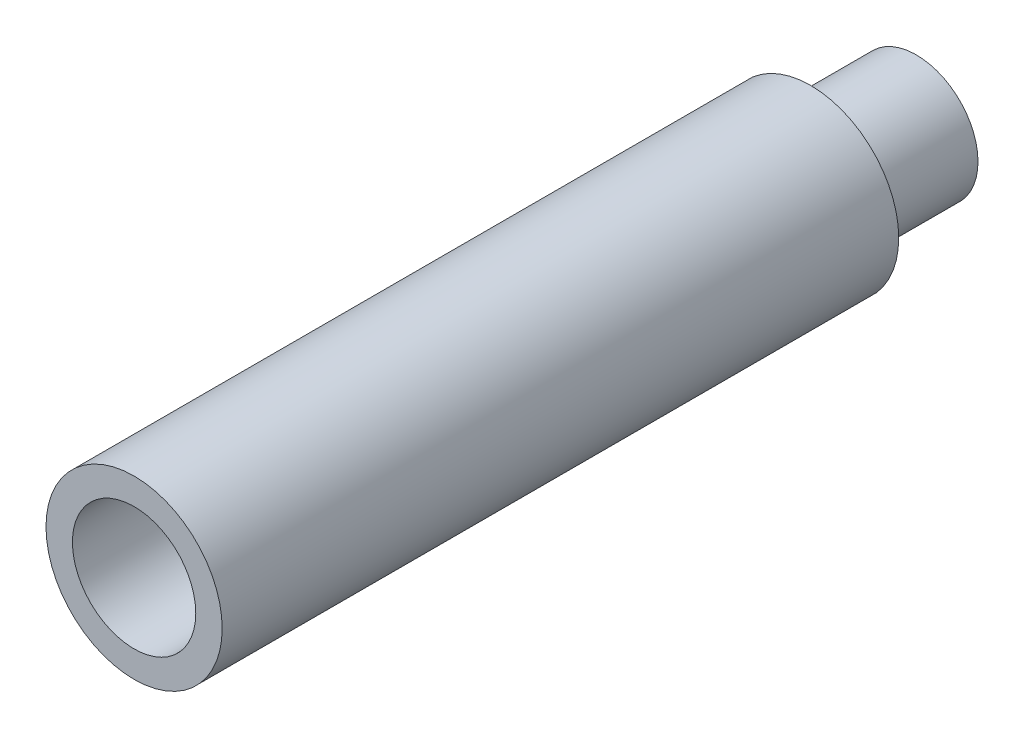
ISO-10303-21;
HEADER;
FILE_DESCRIPTION(('STEP AP214'),'2;1');
FILE_NAME('part.step','',(''),(''),'','','');
FILE_SCHEMA(('AUTOMOTIVE_DESIGN { 1 0 10303 214 1 1 1 1 }'));
ENDSEC;
DATA;
#1=APPLICATION_CONTEXT('core data for automotive mechanical design processes');
#2=APPLICATION_PROTOCOL_DEFINITION('international standard','automotive_design',2000,#1);
#3=PRODUCT_CONTEXT('',#1,'mechanical');
#4=PRODUCT('Part','Part','',(#3));
#5=PRODUCT_RELATED_PRODUCT_CATEGORY('part','',(#4));
#6=PRODUCT_DEFINITION_FORMATION('','',#4);
#7=PRODUCT_DEFINITION_CONTEXT('part definition',#1,'design');
#8=PRODUCT_DEFINITION('design','',#6,#7);
#9=PRODUCT_DEFINITION_SHAPE('','',#8);
#10=(LENGTH_UNIT() NAMED_UNIT(*) SI_UNIT(.MILLI.,.METRE.));
#11=(NAMED_UNIT(*) PLANE_ANGLE_UNIT() SI_UNIT($,.RADIAN.));
#12=(NAMED_UNIT(*) SI_UNIT($,.STERADIAN.) SOLID_ANGLE_UNIT());
#13=UNCERTAINTY_MEASURE_WITH_UNIT(LENGTH_MEASURE(1.E-05),#10,'distance_accuracy_value','');
#14=(GEOMETRIC_REPRESENTATION_CONTEXT(3) GLOBAL_UNCERTAINTY_ASSIGNED_CONTEXT((#13)) GLOBAL_UNIT_ASSIGNED_CONTEXT((#10,
#11,#12)) REPRESENTATION_CONTEXT('',''));
#15=CARTESIAN_POINT('',(0.,0.,0.));
#16=DIRECTION('',(0.,0.,1.));
#17=DIRECTION('',(1.,0.,0.));
#18=AXIS2_PLACEMENT_3D('',#15,#16,#17);
#19=CARTESIAN_POINT('',(0.,0.,-60.96));
#20=DIRECTION('',(0.,0.,1.));
#21=DIRECTION('',(1.,0.,0.));
#22=AXIS2_PLACEMENT_3D('',#19,#20,#21);
#23=PLANE('',#22);
#24=CARTESIAN_POINT('',(0.,0.,-60.96));
#25=DIRECTION('',(0.,0.,1.));
#26=DIRECTION('',(1.,0.,0.));
#27=AXIS2_PLACEMENT_3D('',#24,#25,#26);
#28=CIRCLE('',#27,7.9375);
#29=CARTESIAN_POINT('',(7.9375,0.,-60.96));
#30=VERTEX_POINT('',#29);
#31=EDGE_CURVE('E36',#30,#30,#28,.T.);
#32=ORIENTED_EDGE('',*,*,#31,.F.);
#33=EDGE_LOOP('',(#32));
#34=FACE_BOUND('',#33,.T.);
#35=CARTESIAN_POINT('',(0.,0.,-60.96));
#36=DIRECTION('',(0.,0.,1.));
#37=DIRECTION('',(1.,0.,0.));
#38=AXIS2_PLACEMENT_3D('',#35,#36,#37);
#39=CIRCLE('',#38,5.55625);
#40=CARTESIAN_POINT('',(5.55625,0.,-60.96));
#41=VERTEX_POINT('',#40);
#42=EDGE_CURVE('E10',#41,#41,#39,.F.);
#43=ORIENTED_EDGE('',*,*,#42,.F.);
#44=EDGE_LOOP('',(#43));
#45=FACE_BOUND('',#44,.T.);
#46=ADVANCED_FACE('F29',(#34,#45),#23,.F.);
#47=CARTESIAN_POINT('',(0.,0.,-60.96));
#48=DIRECTION('',(0.,0.,1.));
#49=DIRECTION('',(1.,0.,0.));
#50=AXIS2_PLACEMENT_3D('',#47,#48,#49);
#51=CYLINDRICAL_SURFACE('',#50,7.9375);
#52=CARTESIAN_POINT('',(0.,0.,0.));
#53=DIRECTION('',(0.,0.,1.));
#54=DIRECTION('',(1.,0.,0.));
#55=AXIS2_PLACEMENT_3D('',#52,#53,#54);
#56=CIRCLE('',#55,7.9375);
#57=CARTESIAN_POINT('',(7.9375,0.,0.));
#58=VERTEX_POINT('',#57);
#59=EDGE_CURVE('E40',#58,#58,#56,.T.);
#60=CARTESIAN_POINT('',(7.9375,0.,-60.96));
#61=CARTESIAN_POINT('',(7.9375,0.,-60.325));
#62=CARTESIAN_POINT('',(7.9375,0.,-59.69));
#63=CARTESIAN_POINT('',(7.9375,0.,-58.42));
#64=CARTESIAN_POINT('',(7.9375,0.,-57.785));
#65=CARTESIAN_POINT('',(7.9375,0.,-56.515));
#66=CARTESIAN_POINT('',(7.9375,0.,-55.88));
#67=CARTESIAN_POINT('',(7.9375,0.,-54.61));
#68=CARTESIAN_POINT('',(7.9375,0.,-53.975));
#69=CARTESIAN_POINT('',(7.9375,0.,-52.705));
#70=CARTESIAN_POINT('',(7.9375,0.,-52.07));
#71=CARTESIAN_POINT('',(7.9375,0.,-50.8));
#72=CARTESIAN_POINT('',(7.9375,0.,-50.165));
#73=CARTESIAN_POINT('',(7.9375,0.,-48.895));
#74=CARTESIAN_POINT('',(7.9375,0.,-48.26));
#75=CARTESIAN_POINT('',(7.9375,0.,-46.99));
#76=CARTESIAN_POINT('',(7.9375,0.,-46.355));
#77=CARTESIAN_POINT('',(7.9375,0.,-45.085));
#78=CARTESIAN_POINT('',(7.9375,0.,-44.45));
#79=CARTESIAN_POINT('',(7.9375,0.,-43.18));
#80=CARTESIAN_POINT('',(7.9375,0.,-42.545));
#81=CARTESIAN_POINT('',(7.9375,0.,-41.275));
#82=CARTESIAN_POINT('',(7.9375,0.,-40.64));
#83=CARTESIAN_POINT('',(7.9375,0.,-39.37));
#84=CARTESIAN_POINT('',(7.9375,0.,-38.735));
#85=CARTESIAN_POINT('',(7.9375,0.,-37.465));
#86=CARTESIAN_POINT('',(7.9375,0.,-36.83));
#87=CARTESIAN_POINT('',(7.9375,0.,-35.56));
#88=CARTESIAN_POINT('',(7.9375,0.,-34.925));
#89=CARTESIAN_POINT('',(7.9375,0.,-33.655));
#90=CARTESIAN_POINT('',(7.9375,0.,-33.02));
#91=CARTESIAN_POINT('',(7.9375,0.,-31.75));
#92=CARTESIAN_POINT('',(7.9375,0.,-31.115));
#93=CARTESIAN_POINT('',(7.9375,0.,-29.845));
#94=CARTESIAN_POINT('',(7.9375,0.,-29.21));
#95=CARTESIAN_POINT('',(7.9375,0.,-27.94));
#96=CARTESIAN_POINT('',(7.9375,0.,-27.305));
#97=CARTESIAN_POINT('',(7.9375,0.,-26.035));
#98=CARTESIAN_POINT('',(7.9375,0.,-25.4));
#99=CARTESIAN_POINT('',(7.9375,0.,-24.13));
#100=CARTESIAN_POINT('',(7.9375,0.,-23.495));
#101=CARTESIAN_POINT('',(7.9375,0.,-22.225));
#102=CARTESIAN_POINT('',(7.9375,0.,-21.59));
#103=CARTESIAN_POINT('',(7.9375,0.,-20.32));
#104=CARTESIAN_POINT('',(7.9375,0.,-19.685));
#105=CARTESIAN_POINT('',(7.9375,0.,-18.415));
#106=CARTESIAN_POINT('',(7.9375,0.,-17.78));
#107=CARTESIAN_POINT('',(7.9375,0.,-16.51));
#108=CARTESIAN_POINT('',(7.9375,0.,-15.875));
#109=CARTESIAN_POINT('',(7.9375,0.,-14.605));
#110=CARTESIAN_POINT('',(7.9375,0.,-13.97));
#111=CARTESIAN_POINT('',(7.9375,0.,-12.7));
#112=CARTESIAN_POINT('',(7.9375,0.,-12.065));
#113=CARTESIAN_POINT('',(7.9375,0.,-10.795));
#114=CARTESIAN_POINT('',(7.9375,0.,-10.16));
#115=CARTESIAN_POINT('',(7.9375,0.,-8.89));
#116=CARTESIAN_POINT('',(7.9375,0.,-8.255));
#117=CARTESIAN_POINT('',(7.9375,0.,-6.985));
#118=CARTESIAN_POINT('',(7.9375,0.,-6.35));
#119=CARTESIAN_POINT('',(7.9375,0.,-5.08));
#120=CARTESIAN_POINT('',(7.9375,0.,-4.445));
#121=CARTESIAN_POINT('',(7.9375,0.,-3.175));
#122=CARTESIAN_POINT('',(7.9375,0.,-2.54));
#123=CARTESIAN_POINT('',(7.9375,0.,-1.27));
#124=CARTESIAN_POINT('',(7.9375,0.,-0.634999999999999));
#125=CARTESIAN_POINT('',(7.9375,0.,0.));
#126=B_SPLINE_CURVE_WITH_KNOTS('',3,(#60,#61,#62,#63,#64,#65,#66,#67,#68,#69,#70,#71,#72,#73,
#74,#75,#76,#77,#78,#79,#80,#81,#82,#83,#84,#85,#86,#87,#88,#89,#90,#91,#92,#93,#94,#95,#96,#97,
#98,#99,#100,#101,#102,#103,#104,#105,#106,#107,#108,#109,#110,#111,#112,#113,#114,#115,#116,
#117,#118,#119,#120,#121,#122,#123,#124,#125),.UNSPECIFIED.,.F.,.F.,(4,2,2,2,2,2,2,2,2,2,2,2,2,
2,2,2,2,2,2,2,2,2,2,2,2,2,2,2,2,2,2,2,4),(0.,1.905,3.81,5.71500000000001,7.62,9.52500000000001,
11.43,13.335,15.24,17.145,19.05,20.955,22.86,24.765,26.67,28.575,30.48,32.385,34.29,36.195,38.1,
40.005,41.91,43.815,45.72,47.625,49.53,51.435,53.34,55.245,57.15,59.055,60.96),.UNSPECIFIED.);
#127=EDGE_CURVE('BSEAM31',#30,#58,#126,.T.);
#128=ORIENTED_EDGE('',*,*,#31,.T.);
#129=ORIENTED_EDGE('',*,*,#59,.F.);
#130=ORIENTED_EDGE('',*,*,#127,.T.);
#131=ORIENTED_EDGE('',*,*,#127,.F.);
#132=EDGE_LOOP('',(#128,#130,#129,#131));
#133=FACE_BOUND('',#132,.T.);
#134=ADVANCED_FACE('F31',(#133),#51,.T.);
#135=CARTESIAN_POINT('',(0.,0.,0.));
#136=DIRECTION('',(0.,0.,1.));
#137=DIRECTION('',(1.,0.,0.));
#138=AXIS2_PLACEMENT_3D('',#135,#136,#137);
#139=PLANE('',#138);
#140=CARTESIAN_POINT('',(0.,0.,0.));
#141=DIRECTION('',(0.,0.,1.));
#142=DIRECTION('',(1.,0.,0.));
#143=AXIS2_PLACEMENT_3D('',#140,#141,#142);
#144=CIRCLE('',#143,5.55625);
#145=CARTESIAN_POINT('',(5.55625,0.,0.));
#146=VERTEX_POINT('',#145);
#147=EDGE_CURVE('E49',#146,#146,#144,.T.);
#148=ORIENTED_EDGE('',*,*,#147,.F.);
#149=EDGE_LOOP('',(#148));
#150=FACE_BOUND('',#149,.T.);
#151=ORIENTED_EDGE('',*,*,#59,.T.);
#152=EDGE_LOOP('',(#151));
#153=FACE_BOUND('',#152,.T.);
#154=ADVANCED_FACE('F75',(#150,#153),#139,.T.);
#155=CARTESIAN_POINT('',(0.,0.,-25.4));
#156=DIRECTION('',(0.,0.,1.));
#157=DIRECTION('',(1.,0.,0.));
#158=AXIS2_PLACEMENT_3D('',#155,#156,#157);
#159=CYLINDRICAL_SURFACE('',#158,5.55625);
#160=CARTESIAN_POINT('',(0.,0.,-25.4));
#161=DIRECTION('',(0.,0.,1.));
#162=DIRECTION('',(1.,0.,0.));
#163=AXIS2_PLACEMENT_3D('',#160,#161,#162);
#164=CIRCLE('',#163,5.55625);
#165=CARTESIAN_POINT('',(5.55625,0.,-25.4));
#166=VERTEX_POINT('',#165);
#167=EDGE_CURVE('E44',#166,#166,#164,.T.);
#168=ORIENTED_EDGE('',*,*,#167,.F.);
#169=EDGE_LOOP('',(#168));
#170=FACE_BOUND('',#169,.T.);
#171=ORIENTED_EDGE('',*,*,#147,.T.);
#172=EDGE_LOOP('',(#171));
#173=FACE_BOUND('',#172,.T.);
#174=ADVANCED_FACE('F67',(#170,#173),#159,.F.);
#175=CARTESIAN_POINT('',(0.,0.,-25.4));
#176=DIRECTION('',(0.,0.,1.));
#177=DIRECTION('',(1.,0.,0.));
#178=AXIS2_PLACEMENT_3D('',#175,#176,#177);
#179=PLANE('',#178);
#180=ORIENTED_EDGE('',*,*,#167,.T.);
#181=EDGE_LOOP('',(#180));
#182=FACE_BOUND('',#181,.T.);
#183=ADVANCED_FACE('F60',(#182),#179,.T.);
#184=CARTESIAN_POINT('',(0.,0.,-70.485));
#185=DIRECTION('',(0.,0.,1.));
#186=DIRECTION('',(1.,0.,0.));
#187=AXIS2_PLACEMENT_3D('',#184,#185,#186);
#188=CYLINDRICAL_SURFACE('',#187,5.55625);
#189=CARTESIAN_POINT('',(0.,0.,-70.485));
#190=DIRECTION('',(0.,0.,-1.));
#191=DIRECTION('',(-1.,0.,0.));
#192=AXIS2_PLACEMENT_3D('',#189,#190,#191);
#193=CIRCLE('',#192,5.55625);
#194=CARTESIAN_POINT('',(5.55625,0.,-70.485));
#195=VERTEX_POINT('',#194);
#196=EDGE_CURVE('E52',#195,#195,#193,.T.);
#197=CARTESIAN_POINT('',(5.55625,0.,-70.485));
#198=CARTESIAN_POINT('',(5.55625,0.,-70.38578125));
#199=CARTESIAN_POINT('',(5.55625,0.,-70.2865625));
#200=CARTESIAN_POINT('',(5.55625,0.,-70.088125));
#201=CARTESIAN_POINT('',(5.55625,0.,-69.98890625));
#202=CARTESIAN_POINT('',(5.55625,0.,-69.79046875));
#203=CARTESIAN_POINT('',(5.55625,0.,-69.69125));
#204=CARTESIAN_POINT('',(5.55625,0.,-69.4928125));
#205=CARTESIAN_POINT('',(5.55625,0.,-69.39359375));
#206=CARTESIAN_POINT('',(5.55625,0.,-69.19515625));
#207=CARTESIAN_POINT('',(5.55625,0.,-69.0959375));
#208=CARTESIAN_POINT('',(5.55625,0.,-68.8975));
#209=CARTESIAN_POINT('',(5.55625,0.,-68.79828125));
#210=CARTESIAN_POINT('',(5.55625,0.,-68.59984375));
#211=CARTESIAN_POINT('',(5.55625,0.,-68.500625));
#212=CARTESIAN_POINT('',(5.55625,0.,-68.3021875));
#213=CARTESIAN_POINT('',(5.55625,0.,-68.20296875));
#214=CARTESIAN_POINT('',(5.55625,0.,-68.00453125));
#215=CARTESIAN_POINT('',(5.55625,0.,-67.9053125));
#216=CARTESIAN_POINT('',(5.55625,0.,-67.706875));
#217=CARTESIAN_POINT('',(5.55625,0.,-67.60765625));
#218=CARTESIAN_POINT('',(5.55625,0.,-67.40921875));
#219=CARTESIAN_POINT('',(5.55625,0.,-67.31));
#220=CARTESIAN_POINT('',(5.55625,0.,-67.1115625));
#221=CARTESIAN_POINT('',(5.55625,0.,-67.01234375));
#222=CARTESIAN_POINT('',(5.55625,0.,-66.81390625));
#223=CARTESIAN_POINT('',(5.55625,0.,-66.7146875));
#224=CARTESIAN_POINT('',(5.55625,0.,-66.51625));
#225=CARTESIAN_POINT('',(5.55625,0.,-66.41703125));
#226=CARTESIAN_POINT('',(5.55625,0.,-66.21859375));
#227=CARTESIAN_POINT('',(5.55625,0.,-66.119375));
#228=CARTESIAN_POINT('',(5.55625,0.,-65.9209375));
#229=CARTESIAN_POINT('',(5.55625,0.,-65.82171875));
#230=CARTESIAN_POINT('',(5.55625,0.,-65.62328125));
#231=CARTESIAN_POINT('',(5.55625,0.,-65.5240625));
#232=CARTESIAN_POINT('',(5.55625,0.,-65.325625));
#233=CARTESIAN_POINT('',(5.55625,0.,-65.22640625));
#234=CARTESIAN_POINT('',(5.55625,0.,-65.02796875));
#235=CARTESIAN_POINT('',(5.55625,0.,-64.92875));
#236=CARTESIAN_POINT('',(5.55625,0.,-64.7303125));
#237=CARTESIAN_POINT('',(5.55625,0.,-64.63109375));
#238=CARTESIAN_POINT('',(5.55625,0.,-64.43265625));
#239=CARTESIAN_POINT('',(5.55625,0.,-64.3334375));
#240=CARTESIAN_POINT('',(5.55625,0.,-64.135));
#241=CARTESIAN_POINT('',(5.55625,0.,-64.03578125));
#242=CARTESIAN_POINT('',(5.55625,0.,-63.83734375));
#243=CARTESIAN_POINT('',(5.55625,0.,-63.738125));
#244=CARTESIAN_POINT('',(5.55625,0.,-63.5396875));
#245=CARTESIAN_POINT('',(5.55625,0.,-63.44046875));
#246=CARTESIAN_POINT('',(5.55625,0.,-63.24203125));
#247=CARTESIAN_POINT('',(5.55625,0.,-63.1428125));
#248=CARTESIAN_POINT('',(5.55625,0.,-62.944375));
#249=CARTESIAN_POINT('',(5.55625,0.,-62.84515625));
#250=CARTESIAN_POINT('',(5.55625,0.,-62.64671875));
#251=CARTESIAN_POINT('',(5.55625,0.,-62.5475));
#252=CARTESIAN_POINT('',(5.55625,0.,-62.3490625));
#253=CARTESIAN_POINT('',(5.55625,0.,-62.24984375));
#254=CARTESIAN_POINT('',(5.55625,0.,-62.05140625));
#255=CARTESIAN_POINT('',(5.55625,0.,-61.9521875));
#256=CARTESIAN_POINT('',(5.55625,0.,-61.75375));
#257=CARTESIAN_POINT('',(5.55625,0.,-61.65453125));
#258=CARTESIAN_POINT('',(5.55625,0.,-61.45609375));
#259=CARTESIAN_POINT('',(5.55625,0.,-61.356875));
#260=CARTESIAN_POINT('',(5.55625,0.,-61.1584375));
#261=CARTESIAN_POINT('',(5.55625,0.,-61.05921875));
#262=CARTESIAN_POINT('',(5.55625,0.,-60.96));
#263=B_SPLINE_CURVE_WITH_KNOTS('',3,(#197,#198,#199,#200,#201,#202,#203,#204,#205,#206,#207,
#208,#209,#210,#211,#212,#213,#214,#215,#216,#217,#218,#219,#220,#221,#222,#223,#224,#225,#226,
#227,#228,#229,#230,#231,#232,#233,#234,#235,#236,#237,#238,#239,#240,#241,#242,#243,#244,#245,
#246,#247,#248,#249,#250,#251,#252,#253,#254,#255,#256,#257,#258,#259,#260,#261,#262),
.UNSPECIFIED.,.F.,.F.,(4,2,2,2,2,2,2,2,2,2,2,2,2,2,2,2,2,2,2,2,2,2,2,2,2,2,2,2,2,2,2,2,4),(0.,
0.297656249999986,0.595312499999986,0.892968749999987,1.19062499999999,1.48828124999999,
1.78593749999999,2.08359374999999,2.38124999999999,2.67890624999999,2.97656249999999,
3.27421874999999,3.57187499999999,3.86953124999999,4.16718749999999,4.46484374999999,
4.76249999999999,5.06015624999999,5.35781249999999,5.65546874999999,5.95312499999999,
6.25078124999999,6.54843749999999,6.84609374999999,7.14374999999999,7.44140624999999,
7.73906249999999,8.03671874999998,8.33437499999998,8.63203124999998,8.92968749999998,
9.22734374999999,9.52499999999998),.UNSPECIFIED.);
#264=EDGE_CURVE('BSEAM58',#195,#41,#263,.T.);
#265=ORIENTED_EDGE('',*,*,#196,.F.);
#266=ORIENTED_EDGE('',*,*,#42,.T.);
#267=ORIENTED_EDGE('',*,*,#264,.T.);
#268=ORIENTED_EDGE('',*,*,#264,.F.);
#269=EDGE_LOOP('',(#265,#267,#266,#268));
#270=FACE_BOUND('',#269,.T.);
#271=ADVANCED_FACE('F58',(#270),#188,.T.);
#272=CARTESIAN_POINT('',(0.,0.,-70.485));
#273=DIRECTION('',(0.,0.,-1.));
#274=DIRECTION('',(-1.,0.,0.));
#275=AXIS2_PLACEMENT_3D('',#272,#273,#274);
#276=PLANE('',#275);
#277=ORIENTED_EDGE('',*,*,#196,.T.);
#278=EDGE_LOOP('',(#277));
#279=FACE_BOUND('',#278,.T.);
#280=ADVANCED_FACE('F56',(#279),#276,.T.);
#281=CLOSED_SHELL('',(#46,#134,#154,#174,#183,#271,#280));
#282=MANIFOLD_SOLID_BREP('B2',#281);
#283=ADVANCED_BREP_SHAPE_REPRESENTATION('',(#18,#282),#14);
#284=SHAPE_DEFINITION_REPRESENTATION(#9,#283);
ENDSEC;
END-ISO-10303-21;
